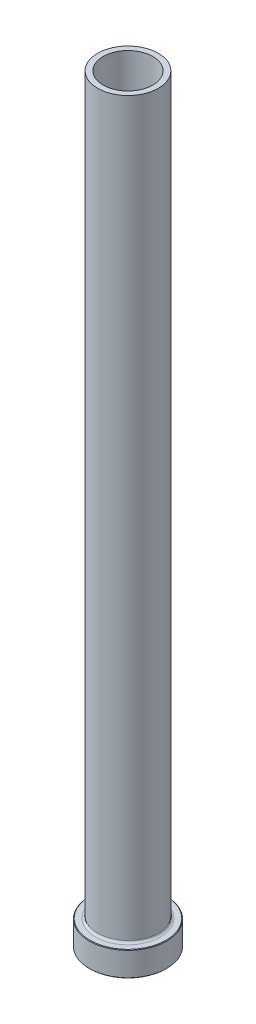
ISO-10303-21;
HEADER;
FILE_DESCRIPTION(('STEP AP214'),'2;1');
FILE_NAME('part.step','',(''),(''),'','','');
FILE_SCHEMA(('AUTOMOTIVE_DESIGN { 1 0 10303 214 1 1 1 1 }'));
ENDSEC;
DATA;
#1=APPLICATION_CONTEXT('core data for automotive mechanical design processes');
#2=APPLICATION_PROTOCOL_DEFINITION('international standard','automotive_design',2000,#1);
#3=PRODUCT_CONTEXT('',#1,'mechanical');
#4=PRODUCT('Part','Part','',(#3));
#5=PRODUCT_RELATED_PRODUCT_CATEGORY('part','',(#4));
#6=PRODUCT_DEFINITION_FORMATION('','',#4);
#7=PRODUCT_DEFINITION_CONTEXT('part definition',#1,'design');
#8=PRODUCT_DEFINITION('design','',#6,#7);
#9=PRODUCT_DEFINITION_SHAPE('','',#8);
#10=(LENGTH_UNIT() NAMED_UNIT(*) SI_UNIT(.MILLI.,.METRE.));
#11=(NAMED_UNIT(*) PLANE_ANGLE_UNIT() SI_UNIT($,.RADIAN.));
#12=(NAMED_UNIT(*) SI_UNIT($,.STERADIAN.) SOLID_ANGLE_UNIT());
#13=UNCERTAINTY_MEASURE_WITH_UNIT(LENGTH_MEASURE(1.E-05),#10,'distance_accuracy_value','');
#14=(GEOMETRIC_REPRESENTATION_CONTEXT(3) GLOBAL_UNCERTAINTY_ASSIGNED_CONTEXT((#13)) GLOBAL_UNIT_ASSIGNED_CONTEXT((#10,
#11,#12)) REPRESENTATION_CONTEXT('',''));
#15=CARTESIAN_POINT('',(0.,0.,0.));
#16=DIRECTION('',(0.,0.,1.));
#17=DIRECTION('',(1.,0.,0.));
#18=AXIS2_PLACEMENT_3D('',#15,#16,#17);
#19=CARTESIAN_POINT('',(0.,92.1876809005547,0.));
#20=DIRECTION('',(0.,1.,0.));
#21=DIRECTION('',(0.,0.,1.));
#22=AXIS2_PLACEMENT_3D('',#19,#20,#21);
#23=CYLINDRICAL_SURFACE('',#22,9.00000000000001);
#24=CARTESIAN_POINT('',(0.,275.,0.));
#25=DIRECTION('',(0.,1.,0.));
#26=DIRECTION('',(0.,0.,1.));
#27=AXIS2_PLACEMENT_3D('',#24,#25,#26);
#28=CIRCLE('',#27,9.00000000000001);
#29=CARTESIAN_POINT('',(0.,275.,9.00000000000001));
#30=VERTEX_POINT('',#29);
#31=EDGE_CURVE('E62',#30,#30,#28,.T.);
#32=ORIENTED_EDGE('',*,*,#31,.T.);
#33=EDGE_LOOP('',(#32));
#34=FACE_BOUND('',#33,.T.);
#35=CARTESIAN_POINT('',(0.,220.,0.));
#36=DIRECTION('',(0.,1.,0.));
#37=DIRECTION('',(0.,0.,1.));
#38=AXIS2_PLACEMENT_3D('',#35,#36,#37);
#39=CIRCLE('',#38,9.00000000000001);
#40=CARTESIAN_POINT('',(0.,220.,9.00000000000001));
#41=VERTEX_POINT('',#40);
#42=EDGE_CURVE('E71',#41,#41,#39,.T.);
#43=ORIENTED_EDGE('',*,*,#42,.F.);
#44=EDGE_LOOP('',(#43));
#45=FACE_BOUND('',#44,.T.);
#46=ADVANCED_FACE('F30',(#34,#45),#23,.F.);
#47=CARTESIAN_POINT('',(-9.00000000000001,275.,0.));
#48=DIRECTION('',(0.,1.,0.));
#49=DIRECTION('',(0.,0.,1.));
#50=AXIS2_PLACEMENT_3D('',#47,#48,#49);
#51=PLANE('',#50);
#52=CARTESIAN_POINT('',(0.,275.,0.));
#53=DIRECTION('',(0.,1.,0.));
#54=DIRECTION('',(0.,0.,1.));
#55=AXIS2_PLACEMENT_3D('',#52,#53,#54);
#56=CIRCLE('',#55,11.);
#57=CARTESIAN_POINT('',(0.,275.,11.));
#58=VERTEX_POINT('',#57);
#59=EDGE_CURVE('E65',#58,#58,#56,.T.);
#60=ORIENTED_EDGE('',*,*,#59,.T.);
#61=EDGE_LOOP('',(#60));
#62=FACE_BOUND('',#61,.T.);
#63=ORIENTED_EDGE('',*,*,#31,.F.);
#64=EDGE_LOOP('',(#63));
#65=FACE_BOUND('',#64,.T.);
#66=ADVANCED_FACE('F79',(#62,#65),#51,.T.);
#67=CARTESIAN_POINT('',(0.,92.1876809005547,0.));
#68=DIRECTION('',(0.,1.,0.));
#69=DIRECTION('',(0.,0.,1.));
#70=AXIS2_PLACEMENT_3D('',#67,#68,#69);
#71=CYLINDRICAL_SURFACE('',#70,11.);
#72=CARTESIAN_POINT('',(0.,9.8,0.));
#73=DIRECTION('',(0.,1.,0.));
#74=DIRECTION('',(0.,0.,1.));
#75=AXIS2_PLACEMENT_3D('',#72,#73,#74);
#76=CIRCLE('',#75,11.);
#77=CARTESIAN_POINT('',(0.,9.8,11.));
#78=VERTEX_POINT('',#77);
#79=EDGE_CURVE('E59',#78,#78,#76,.T.);
#80=ORIENTED_EDGE('',*,*,#79,.T.);
#81=EDGE_LOOP('',(#80));
#82=FACE_BOUND('',#81,.T.);
#83=ORIENTED_EDGE('',*,*,#59,.F.);
#84=EDGE_LOOP('',(#83));
#85=FACE_BOUND('',#84,.T.);
#86=ADVANCED_FACE('F85',(#82,#85),#71,.T.);
#87=CARTESIAN_POINT('',(-11.,9.,0.));
#88=DIRECTION('',(0.,1.,0.));
#89=DIRECTION('',(0.,0.,1.));
#90=AXIS2_PLACEMENT_3D('',#87,#88,#89);
#91=PLANE('',#90);
#92=CARTESIAN_POINT('',(0.,9.,0.));
#93=DIRECTION('',(0.,1.,0.));
#94=DIRECTION('',(0.,0.,1.));
#95=AXIS2_PLACEMENT_3D('',#92,#93,#94);
#96=CIRCLE('',#95,13.8);
#97=CARTESIAN_POINT('',(0.,9.,13.8));
#98=VERTEX_POINT('',#97);
#99=EDGE_CURVE('E53',#98,#98,#96,.T.);
#100=ORIENTED_EDGE('',*,*,#99,.T.);
#101=EDGE_LOOP('',(#100));
#102=FACE_BOUND('',#101,.T.);
#103=CARTESIAN_POINT('',(0.,9.,0.));
#104=DIRECTION('',(0.,1.,0.));
#105=DIRECTION('',(0.,0.,1.));
#106=AXIS2_PLACEMENT_3D('',#103,#104,#105);
#107=CIRCLE('',#106,11.8);
#108=CARTESIAN_POINT('',(0.,9.,11.8));
#109=VERTEX_POINT('',#108);
#110=EDGE_CURVE('E56',#109,#109,#107,.F.);
#111=ORIENTED_EDGE('',*,*,#110,.T.);
#112=EDGE_LOOP('',(#111));
#113=FACE_BOUND('',#112,.T.);
#114=ADVANCED_FACE('F111',(#102,#113),#91,.T.);
#115=CARTESIAN_POINT('',(0.,92.1876809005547,0.));
#116=DIRECTION('',(0.,1.,0.));
#117=DIRECTION('',(0.,0.,1.));
#118=AXIS2_PLACEMENT_3D('',#115,#116,#117);
#119=CYLINDRICAL_SURFACE('',#118,14.);
#120=CARTESIAN_POINT('',(0.,8.8,0.));
#121=DIRECTION('',(0.,1.,0.));
#122=DIRECTION('',(0.,0.,1.));
#123=AXIS2_PLACEMENT_3D('',#120,#121,#122);
#124=CIRCLE('',#123,14.);
#125=CARTESIAN_POINT('',(0.,8.8,14.));
#126=VERTEX_POINT('',#125);
#127=EDGE_CURVE('E45',#126,#126,#124,.F.);
#128=ORIENTED_EDGE('',*,*,#127,.T.);
#129=EDGE_LOOP('',(#128));
#130=FACE_BOUND('',#129,.T.);
#131=CARTESIAN_POINT('',(0.,0.199999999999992,0.));
#132=DIRECTION('',(0.,-1.,0.));
#133=DIRECTION('',(0.,0.,-1.));
#134=AXIS2_PLACEMENT_3D('',#131,#132,#133);
#135=CIRCLE('',#134,14.);
#136=CARTESIAN_POINT('',(0.,0.199999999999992,-14.));
#137=VERTEX_POINT('',#136);
#138=EDGE_CURVE('E50',#137,#137,#135,.F.);
#139=ORIENTED_EDGE('',*,*,#138,.T.);
#140=EDGE_LOOP('',(#139));
#141=FACE_BOUND('',#140,.T.);
#142=ADVANCED_FACE('F108',(#130,#141),#119,.T.);
#143=CARTESIAN_POINT('',(-14.,0.,0.));
#144=DIRECTION('',(0.,-1.,0.));
#145=DIRECTION('',(0.,0.,-1.));
#146=AXIS2_PLACEMENT_3D('',#143,#144,#145);
#147=PLANE('',#146);
#148=CARTESIAN_POINT('',(0.,0.,0.));
#149=DIRECTION('',(0.,-1.,0.));
#150=DIRECTION('',(0.,0.,-1.));
#151=AXIS2_PLACEMENT_3D('',#148,#149,#150);
#152=CIRCLE('',#151,9.74999999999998);
#153=CARTESIAN_POINT('',(0.,0.,-9.74999999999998));
#154=VERTEX_POINT('',#153);
#155=EDGE_CURVE('E37',#154,#154,#152,.F.);
#156=ORIENTED_EDGE('',*,*,#155,.T.);
#157=EDGE_LOOP('',(#156));
#158=FACE_BOUND('',#157,.T.);
#159=CARTESIAN_POINT('',(0.,0.,0.));
#160=DIRECTION('',(0.,-1.,0.));
#161=DIRECTION('',(0.,0.,-1.));
#162=AXIS2_PLACEMENT_3D('',#159,#160,#161);
#163=CIRCLE('',#162,13.8);
#164=CARTESIAN_POINT('',(0.,0.,-13.8));
#165=VERTEX_POINT('',#164);
#166=EDGE_CURVE('E41',#165,#165,#163,.T.);
#167=ORIENTED_EDGE('',*,*,#166,.T.);
#168=EDGE_LOOP('',(#167));
#169=FACE_BOUND('',#168,.T.);
#170=ADVANCED_FACE('F110',(#158,#169),#147,.T.);
#171=CARTESIAN_POINT('',(0.,92.1876809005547,0.));
#172=DIRECTION('',(0.,1.,0.));
#173=DIRECTION('',(0.,0.,1.));
#174=AXIS2_PLACEMENT_3D('',#171,#172,#173);
#175=CYLINDRICAL_SURFACE('',#174,9.25);
#176=CARTESIAN_POINT('',(0.,0.499999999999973,0.));
#177=DIRECTION('',(0.,-1.,0.));
#178=DIRECTION('',(0.,0.,-1.));
#179=AXIS2_PLACEMENT_3D('',#176,#177,#178);
#180=CIRCLE('',#179,9.25);
#181=CARTESIAN_POINT('',(0.,0.499999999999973,-9.25));
#182=VERTEX_POINT('',#181);
#183=EDGE_CURVE('E10',#182,#182,#180,.T.);
#184=ORIENTED_EDGE('',*,*,#183,.T.);
#185=EDGE_LOOP('',(#184));
#186=FACE_BOUND('',#185,.T.);
#187=CARTESIAN_POINT('',(0.,208.,0.));
#188=DIRECTION('',(0.,1.,0.));
#189=DIRECTION('',(0.,0.,1.));
#190=AXIS2_PLACEMENT_3D('',#187,#188,#189);
#191=CIRCLE('',#190,9.25000000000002);
#192=CARTESIAN_POINT('',(0.,208.,9.25000000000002));
#193=VERTEX_POINT('',#192);
#194=EDGE_CURVE('E68',#193,#193,#191,.T.);
#195=ORIENTED_EDGE('',*,*,#194,.T.);
#196=EDGE_LOOP('',(#195));
#197=FACE_BOUND('',#196,.T.);
#198=ADVANCED_FACE('F118',(#186,#197),#175,.F.);
#199=CARTESIAN_POINT('',(0.,208.,0.));
#200=DIRECTION('',(0.,-1.,0.));
#201=DIRECTION('',(0.,0.,-1.));
#202=AXIS2_PLACEMENT_3D('',#199,#200,#201);
#203=CONICAL_SURFACE('',#202,9.25000000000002,0.0208303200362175);
#204=ORIENTED_EDGE('',*,*,#42,.T.);
#205=EDGE_LOOP('',(#204));
#206=FACE_BOUND('',#205,.T.);
#207=ORIENTED_EDGE('',*,*,#194,.F.);
#208=EDGE_LOOP('',(#207));
#209=FACE_BOUND('',#208,.T.);
#210=ADVANCED_FACE('F75',(#206,#209),#203,.F.);
#211=CARTESIAN_POINT('',(0.,9.8,0.));
#212=DIRECTION('',(0.,1.,0.));
#213=DIRECTION('',(0.,0.,1.));
#214=AXIS2_PLACEMENT_3D('',#211,#212,#213);
#215=TOROIDAL_SURFACE('',#214,11.8,0.8);
#216=ORIENTED_EDGE('',*,*,#110,.F.);
#217=EDGE_LOOP('',(#216));
#218=FACE_BOUND('',#217,.T.);
#219=ORIENTED_EDGE('',*,*,#79,.F.);
#220=EDGE_LOOP('',(#219));
#221=FACE_BOUND('',#220,.T.);
#222=ADVANCED_FACE('F90',(#218,#221),#215,.F.);
#223=CARTESIAN_POINT('',(0.,8.99999999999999,0.));
#224=DIRECTION('',(0.,-1.,0.));
#225=DIRECTION('',(0.,0.,-1.));
#226=AXIS2_PLACEMENT_3D('',#223,#224,#225);
#227=CONICAL_SURFACE('',#226,13.8,0.785398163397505);
#228=ORIENTED_EDGE('',*,*,#127,.F.);
#229=EDGE_LOOP('',(#228));
#230=FACE_BOUND('',#229,.T.);
#231=ORIENTED_EDGE('',*,*,#99,.F.);
#232=EDGE_LOOP('',(#231));
#233=FACE_BOUND('',#232,.T.);
#234=ADVANCED_FACE('F93',(#230,#233),#227,.T.);
#235=CARTESIAN_POINT('',(0.,0.199999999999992,0.));
#236=DIRECTION('',(0.,1.,0.));
#237=DIRECTION('',(0.,0.,1.));
#238=AXIS2_PLACEMENT_3D('',#235,#236,#237);
#239=CONICAL_SURFACE('',#238,14.,0.785398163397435);
#240=ORIENTED_EDGE('',*,*,#166,.F.);
#241=EDGE_LOOP('',(#240));
#242=FACE_BOUND('',#241,.T.);
#243=ORIENTED_EDGE('',*,*,#138,.F.);
#244=EDGE_LOOP('',(#243));
#245=FACE_BOUND('',#244,.T.);
#246=ADVANCED_FACE('F96',(#242,#245),#239,.T.);
#247=CARTESIAN_POINT('',(0.,0.,0.));
#248=DIRECTION('',(0.,-1.,0.));
#249=DIRECTION('',(0.,0.,-1.));
#250=AXIS2_PLACEMENT_3D('',#247,#248,#249);
#251=CONICAL_SURFACE('',#250,9.74999999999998,0.785398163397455);
#252=ORIENTED_EDGE('',*,*,#183,.F.);
#253=EDGE_LOOP('',(#252));
#254=FACE_BOUND('',#253,.T.);
#255=ORIENTED_EDGE('',*,*,#155,.F.);
#256=EDGE_LOOP('',(#255));
#257=FACE_BOUND('',#256,.T.);
#258=ADVANCED_FACE('F32',(#254,#257),#251,.F.);
#259=CLOSED_SHELL('',(#46,#66,#86,#114,#142,#170,#198,#210,#222,#234,#246,#258));
#260=MANIFOLD_SOLID_BREP('B2',#259);
#261=ADVANCED_BREP_SHAPE_REPRESENTATION('',(#18,#260),#14);
#262=SHAPE_DEFINITION_REPRESENTATION(#9,#261);
ENDSEC;
END-ISO-10303-21;
